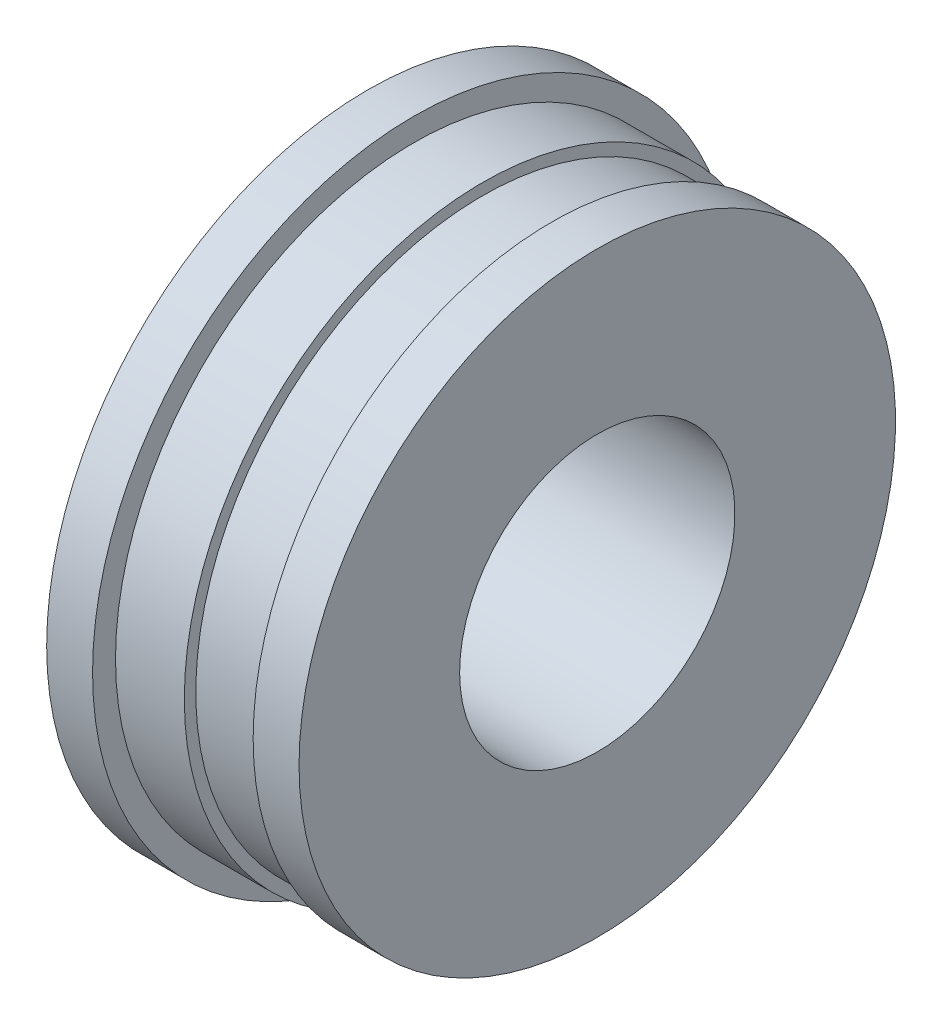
ISO-10303-21;
HEADER;
FILE_DESCRIPTION(('STEP AP214'),'2;1');
FILE_NAME('part.step','',(''),(''),'','','');
FILE_SCHEMA(('AUTOMOTIVE_DESIGN { 1 0 10303 214 1 1 1 1 }'));
ENDSEC;
DATA;
#1=APPLICATION_CONTEXT('core data for automotive mechanical design processes');
#2=APPLICATION_PROTOCOL_DEFINITION('international standard','automotive_design',2000,#1);
#3=PRODUCT_CONTEXT('',#1,'mechanical');
#4=PRODUCT('Part','Part','',(#3));
#5=PRODUCT_RELATED_PRODUCT_CATEGORY('part','',(#4));
#6=PRODUCT_DEFINITION_FORMATION('','',#4);
#7=PRODUCT_DEFINITION_CONTEXT('part definition',#1,'design');
#8=PRODUCT_DEFINITION('design','',#6,#7);
#9=PRODUCT_DEFINITION_SHAPE('','',#8);
#10=(LENGTH_UNIT() NAMED_UNIT(*) SI_UNIT(.MILLI.,.METRE.));
#11=(NAMED_UNIT(*) PLANE_ANGLE_UNIT() SI_UNIT($,.RADIAN.));
#12=(NAMED_UNIT(*) SI_UNIT($,.STERADIAN.) SOLID_ANGLE_UNIT());
#13=UNCERTAINTY_MEASURE_WITH_UNIT(LENGTH_MEASURE(1.E-05),#10,'distance_accuracy_value','');
#14=(GEOMETRIC_REPRESENTATION_CONTEXT(3) GLOBAL_UNCERTAINTY_ASSIGNED_CONTEXT((#13)) GLOBAL_UNIT_ASSIGNED_CONTEXT((#10,
#11,#12)) REPRESENTATION_CONTEXT('',''));
#15=CARTESIAN_POINT('',(0.,0.,0.));
#16=DIRECTION('',(0.,0.,1.));
#17=DIRECTION('',(1.,0.,0.));
#18=AXIS2_PLACEMENT_3D('',#15,#16,#17);
#19=CARTESIAN_POINT('',(0.,0.,0.));
#20=DIRECTION('',(-1.,0.,0.));
#21=DIRECTION('',(0.,0.,1.));
#22=AXIS2_PLACEMENT_3D('',#19,#20,#21);
#23=CYLINDRICAL_SURFACE('',#22,13.);
#24=CARTESIAN_POINT('',(5.,0.,0.));
#25=DIRECTION('',(-1.,0.,0.));
#26=DIRECTION('',(0.,0.,1.));
#27=AXIS2_PLACEMENT_3D('',#24,#25,#26);
#28=CIRCLE('',#27,13.);
#29=CARTESIAN_POINT('',(5.,0.,13.));
#30=VERTEX_POINT('',#29);
#31=EDGE_CURVE('E42',#30,#30,#28,.T.);
#32=ORIENTED_EDGE('',*,*,#31,.T.);
#33=EDGE_LOOP('',(#32));
#34=FACE_BOUND('',#33,.T.);
#35=CARTESIAN_POINT('',(2.,0.,0.));
#36=DIRECTION('',(-1.,0.,0.));
#37=DIRECTION('',(0.,0.,1.));
#38=AXIS2_PLACEMENT_3D('',#35,#36,#37);
#39=CIRCLE('',#38,13.);
#40=CARTESIAN_POINT('',(2.,0.,13.));
#41=VERTEX_POINT('',#40);
#42=EDGE_CURVE('E51',#41,#41,#39,.T.);
#43=ORIENTED_EDGE('',*,*,#42,.F.);
#44=EDGE_LOOP('',(#43));
#45=FACE_BOUND('',#44,.T.);
#46=ADVANCED_FACE('F38',(#34,#45),#23,.T.);
#47=CARTESIAN_POINT('',(0.,0.,0.));
#48=DIRECTION('',(-1.,0.,0.));
#49=DIRECTION('',(0.,0.,1.));
#50=AXIS2_PLACEMENT_3D('',#47,#48,#49);
#51=CYLINDRICAL_SURFACE('',#50,6.);
#52=CARTESIAN_POINT('',(10.,0.,0.));
#53=DIRECTION('',(-1.,0.,0.));
#54=DIRECTION('',(0.,0.,1.));
#55=AXIS2_PLACEMENT_3D('',#52,#53,#54);
#56=CIRCLE('',#55,6.);
#57=CARTESIAN_POINT('',(10.,0.,6.));
#58=VERTEX_POINT('',#57);
#59=EDGE_CURVE('E12',#58,#58,#56,.T.);
#60=ORIENTED_EDGE('',*,*,#59,.F.);
#61=EDGE_LOOP('',(#60));
#62=FACE_BOUND('',#61,.T.);
#63=CARTESIAN_POINT('',(0.,0.,0.));
#64=DIRECTION('',(-1.,0.,0.));
#65=DIRECTION('',(0.,0.,1.));
#66=AXIS2_PLACEMENT_3D('',#63,#64,#65);
#67=CIRCLE('',#66,6.);
#68=CARTESIAN_POINT('',(0.,0.,6.));
#69=VERTEX_POINT('',#68);
#70=EDGE_CURVE('E60',#69,#69,#67,.T.);
#71=ORIENTED_EDGE('',*,*,#70,.T.);
#72=EDGE_LOOP('',(#71));
#73=FACE_BOUND('',#72,.T.);
#74=ADVANCED_FACE('F40',(#62,#73),#51,.F.);
#75=CARTESIAN_POINT('',(10.,6.00000000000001,0.));
#76=DIRECTION('',(-1.,0.,0.));
#77=DIRECTION('',(0.,0.,1.));
#78=AXIS2_PLACEMENT_3D('',#75,#76,#77);
#79=PLANE('',#78);
#80=CARTESIAN_POINT('',(10.,0.,0.));
#81=DIRECTION('',(-1.,0.,0.));
#82=DIRECTION('',(0.,0.,1.));
#83=AXIS2_PLACEMENT_3D('',#80,#81,#82);
#84=CIRCLE('',#83,13.);
#85=CARTESIAN_POINT('',(10.,0.,13.));
#86=VERTEX_POINT('',#85);
#87=EDGE_CURVE('E46',#86,#86,#84,.T.);
#88=ORIENTED_EDGE('',*,*,#87,.F.);
#89=EDGE_LOOP('',(#88));
#90=FACE_BOUND('',#89,.T.);
#91=ORIENTED_EDGE('',*,*,#59,.T.);
#92=EDGE_LOOP('',(#91));
#93=FACE_BOUND('',#92,.T.);
#94=ADVANCED_FACE('F90',(#90,#93),#79,.F.);
#95=CARTESIAN_POINT('',(7.99999999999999,0.,0.));
#96=DIRECTION('',(1.,0.,0.));
#97=DIRECTION('',(0.,0.,-1.));
#98=AXIS2_PLACEMENT_3D('',#95,#96,#97);
#99=CIRCLE('',#98,13.);
#100=CARTESIAN_POINT('',(7.99999999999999,0.,-13.));
#101=VERTEX_POINT('',#100);
#102=EDGE_CURVE('E54',#101,#101,#99,.T.);
#103=ORIENTED_EDGE('',*,*,#102,.T.);
#104=EDGE_LOOP('',(#103));
#105=FACE_BOUND('',#104,.T.);
#106=ORIENTED_EDGE('',*,*,#87,.T.);
#107=EDGE_LOOP('',(#106));
#108=FACE_BOUND('',#107,.T.);
#109=ADVANCED_FACE('F84',(#105,#108),#23,.T.);
#110=CARTESIAN_POINT('',(2.,13.,0.));
#111=DIRECTION('',(-1.,0.,0.));
#112=DIRECTION('',(0.,0.,1.));
#113=AXIS2_PLACEMENT_3D('',#110,#111,#112);
#114=PLANE('',#113);
#115=CARTESIAN_POINT('',(2.,0.,0.));
#116=DIRECTION('',(-1.,0.,0.));
#117=DIRECTION('',(0.,0.,1.));
#118=AXIS2_PLACEMENT_3D('',#115,#116,#117);
#119=CIRCLE('',#118,14.);
#120=CARTESIAN_POINT('',(2.,0.,14.));
#121=VERTEX_POINT('',#120);
#122=EDGE_CURVE('E74',#121,#121,#119,.T.);
#123=ORIENTED_EDGE('',*,*,#122,.F.);
#124=EDGE_LOOP('',(#123));
#125=FACE_BOUND('',#124,.T.);
#126=ORIENTED_EDGE('',*,*,#42,.T.);
#127=EDGE_LOOP('',(#126));
#128=FACE_BOUND('',#127,.T.);
#129=ADVANCED_FACE('F79',(#125,#128),#114,.F.);
#130=CARTESIAN_POINT('',(0.,0.,0.));
#131=DIRECTION('',(-1.,0.,0.));
#132=DIRECTION('',(0.,0.,1.));
#133=AXIS2_PLACEMENT_3D('',#130,#131,#132);
#134=CYLINDRICAL_SURFACE('',#133,14.);
#135=CARTESIAN_POINT('',(0.,0.,0.));
#136=DIRECTION('',(-1.,0.,0.));
#137=DIRECTION('',(0.,0.,1.));
#138=AXIS2_PLACEMENT_3D('',#135,#136,#137);
#139=CIRCLE('',#138,14.);
#140=CARTESIAN_POINT('',(0.,0.,14.));
#141=VERTEX_POINT('',#140);
#142=EDGE_CURVE('E71',#141,#141,#139,.T.);
#143=ORIENTED_EDGE('',*,*,#142,.F.);
#144=EDGE_LOOP('',(#143));
#145=FACE_BOUND('',#144,.T.);
#146=ORIENTED_EDGE('',*,*,#122,.T.);
#147=EDGE_LOOP('',(#146));
#148=FACE_BOUND('',#147,.T.);
#149=ADVANCED_FACE('F98',(#145,#148),#134,.T.);
#150=CARTESIAN_POINT('',(0.,6.00000000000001,0.));
#151=DIRECTION('',(1.,0.,0.));
#152=DIRECTION('',(0.,0.,-1.));
#153=AXIS2_PLACEMENT_3D('',#150,#151,#152);
#154=PLANE('',#153);
#155=ORIENTED_EDGE('',*,*,#70,.F.);
#156=EDGE_LOOP('',(#155));
#157=FACE_BOUND('',#156,.T.);
#158=ORIENTED_EDGE('',*,*,#142,.T.);
#159=EDGE_LOOP('',(#158));
#160=FACE_BOUND('',#159,.T.);
#161=ADVANCED_FACE('F110',(#157,#160),#154,.F.);
#162=CARTESIAN_POINT('',(5.,18.949043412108,0.));
#163=DIRECTION('',(-1.,0.,0.));
#164=DIRECTION('',(0.,0.,1.));
#165=AXIS2_PLACEMENT_3D('',#162,#163,#164);
#166=PLANE('',#165);
#167=CARTESIAN_POINT('',(5.,0.,0.));
#168=DIRECTION('',(1.,0.,0.));
#169=DIRECTION('',(0.,0.,-1.));
#170=AXIS2_PLACEMENT_3D('',#167,#168,#169);
#171=CIRCLE('',#170,12.5);
#172=CARTESIAN_POINT('',(5.,0.,-12.5));
#173=VERTEX_POINT('',#172);
#174=EDGE_CURVE('E56',#173,#173,#171,.T.);
#175=ORIENTED_EDGE('',*,*,#174,.F.);
#176=EDGE_LOOP('',(#175));
#177=FACE_BOUND('',#176,.T.);
#178=ORIENTED_EDGE('',*,*,#31,.F.);
#179=EDGE_LOOP('',(#178));
#180=FACE_BOUND('',#179,.T.);
#181=ADVANCED_FACE('F116',(#177,#180),#166,.F.);
#182=CARTESIAN_POINT('',(8.,18.949043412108,0.));
#183=DIRECTION('',(1.,0.,0.));
#184=DIRECTION('',(0.,0.,-1.));
#185=AXIS2_PLACEMENT_3D('',#182,#183,#184);
#186=PLANE('',#185);
#187=CARTESIAN_POINT('',(7.99999999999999,0.,0.));
#188=DIRECTION('',(1.,0.,0.));
#189=DIRECTION('',(0.,0.,-1.));
#190=AXIS2_PLACEMENT_3D('',#187,#188,#189);
#191=CIRCLE('',#190,12.5);
#192=CARTESIAN_POINT('',(7.99999999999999,0.,-12.5));
#193=VERTEX_POINT('',#192);
#194=EDGE_CURVE('E62',#193,#193,#191,.T.);
#195=ORIENTED_EDGE('',*,*,#194,.T.);
#196=EDGE_LOOP('',(#195));
#197=FACE_BOUND('',#196,.T.);
#198=ORIENTED_EDGE('',*,*,#102,.F.);
#199=EDGE_LOOP('',(#198));
#200=FACE_BOUND('',#199,.T.);
#201=ADVANCED_FACE('F119',(#197,#200),#186,.F.);
#202=CARTESIAN_POINT('',(49.5426642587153,0.,0.));
#203=DIRECTION('',(1.,0.,0.));
#204=DIRECTION('',(0.,0.,-1.));
#205=AXIS2_PLACEMENT_3D('',#202,#203,#204);
#206=CYLINDRICAL_SURFACE('',#205,12.5);
#207=ORIENTED_EDGE('',*,*,#194,.F.);
#208=EDGE_LOOP('',(#207));
#209=FACE_BOUND('',#208,.T.);
#210=ORIENTED_EDGE('',*,*,#174,.T.);
#211=EDGE_LOOP('',(#210));
#212=FACE_BOUND('',#211,.T.);
#213=ADVANCED_FACE('F121',(#209,#212),#206,.T.);
#214=CLOSED_SHELL('',(#46,#74,#94,#109,#129,#149,#161,#181,#201,#213));
#215=MANIFOLD_SOLID_BREP('B2',#214);
#216=ADVANCED_BREP_SHAPE_REPRESENTATION('',(#18,#215),#14);
#217=SHAPE_DEFINITION_REPRESENTATION(#9,#216);
ENDSEC;
END-ISO-10303-21;
